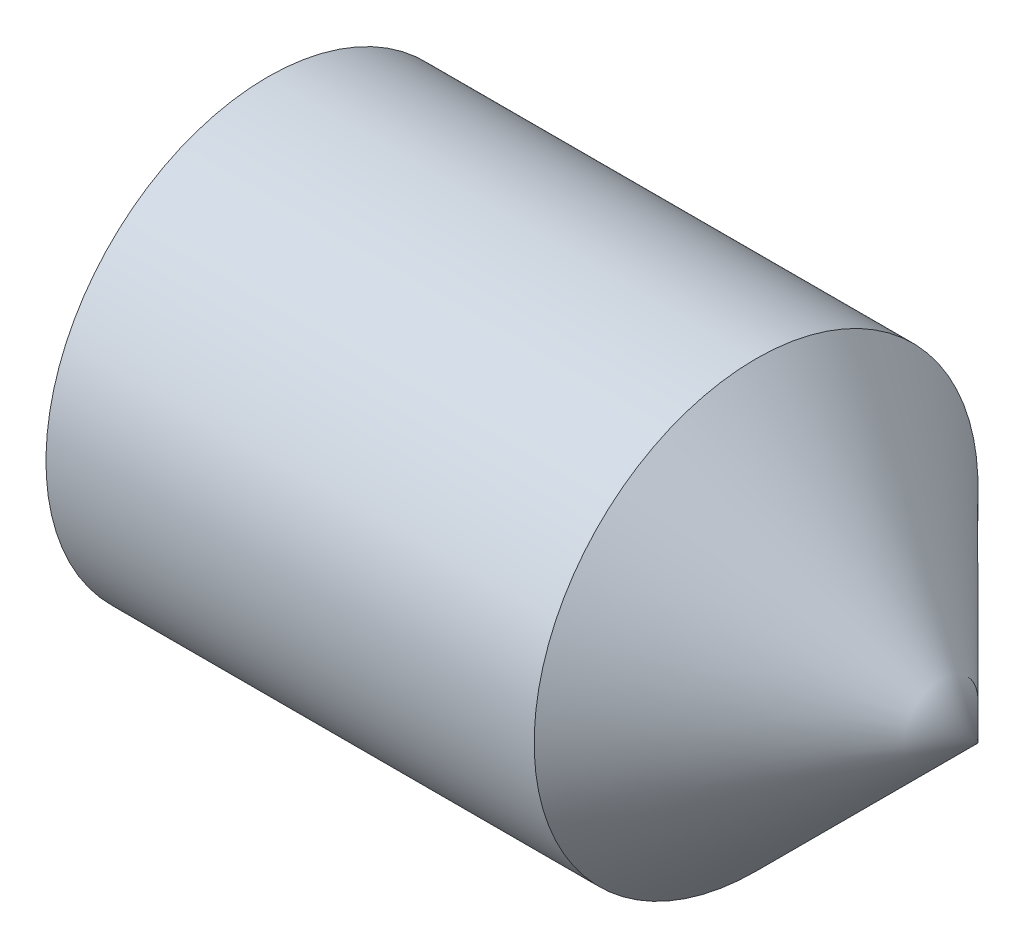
ISO-10303-21;
HEADER;
FILE_DESCRIPTION(('STEP AP214'),'2;1');
FILE_NAME('part.step','',(''),(''),'','','');
FILE_SCHEMA(('AUTOMOTIVE_DESIGN { 1 0 10303 214 1 1 1 1 }'));
ENDSEC;
DATA;
#1=APPLICATION_CONTEXT('core data for automotive mechanical design processes');
#2=APPLICATION_PROTOCOL_DEFINITION('international standard','automotive_design',2000,#1);
#3=PRODUCT_CONTEXT('',#1,'mechanical');
#4=PRODUCT('Part','Part','',(#3));
#5=PRODUCT_RELATED_PRODUCT_CATEGORY('part','',(#4));
#6=PRODUCT_DEFINITION_FORMATION('','',#4);
#7=PRODUCT_DEFINITION_CONTEXT('part definition',#1,'design');
#8=PRODUCT_DEFINITION('design','',#6,#7);
#9=PRODUCT_DEFINITION_SHAPE('','',#8);
#10=(LENGTH_UNIT() NAMED_UNIT(*) SI_UNIT(.MILLI.,.METRE.));
#11=(NAMED_UNIT(*) PLANE_ANGLE_UNIT() SI_UNIT($,.RADIAN.));
#12=(NAMED_UNIT(*) SI_UNIT($,.STERADIAN.) SOLID_ANGLE_UNIT());
#13=UNCERTAINTY_MEASURE_WITH_UNIT(LENGTH_MEASURE(1.E-05),#10,'distance_accuracy_value','');
#14=(GEOMETRIC_REPRESENTATION_CONTEXT(3) GLOBAL_UNCERTAINTY_ASSIGNED_CONTEXT((#13)) GLOBAL_UNIT_ASSIGNED_CONTEXT((#10,
#11,#12)) REPRESENTATION_CONTEXT('',''));
#15=CARTESIAN_POINT('',(0.,0.,0.));
#16=DIRECTION('',(0.,0.,1.));
#17=DIRECTION('',(1.,0.,0.));
#18=AXIS2_PLACEMENT_3D('',#15,#16,#17);
#19=CARTESIAN_POINT('',(0.,3.96874999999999,0.));
#20=DIRECTION('',(-1.,0.,0.));
#21=DIRECTION('',(0.,-1.,0.));
#22=AXIS2_PLACEMENT_3D('',#19,#20,#21);
#23=PLANE('',#22);
#24=DIRECTION('',(0.,0.709496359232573,0.70470910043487));
#25=VECTOR('',#24,1.);
#26=CARTESIAN_POINT('',(0.,-2.20772449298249,0.599575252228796));
#27=LINE('',#26,#25);
#28=CARTESIAN_POINT('',(0.,-2.20772449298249,0.599575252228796));
#29=VERTEX_POINT('',#28);
#30=CARTESIAN_POINT('',(0.,-0.584614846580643,2.21173312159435));
#31=VERTEX_POINT('',#30);
#32=EDGE_CURVE('E395',#29,#31,#27,.T.);
#33=ORIENTED_EDGE('',*,*,#32,.F.);
#34=DIRECTION('',(0.,-0.255547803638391,0.966796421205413));
#35=VECTOR('',#34,1.);
#36=CARTESIAN_POINT('',(0.,-1.62310964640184,-1.61215786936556));
#37=LINE('',#36,#35);
#38=CARTESIAN_POINT('',(0.,-1.62310964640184,-1.61215786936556));
#39=VERTEX_POINT('',#38);
#40=EDGE_CURVE('E463',#39,#29,#37,.T.);
#41=ORIENTED_EDGE('',*,*,#40,.F.);
#42=DIRECTION('',(0.,-0.965044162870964,0.262087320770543));
#43=VECTOR('',#42,1.);
#44=CARTESIAN_POINT('',(0.,0.584614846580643,-2.21173312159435));
#45=LINE('',#44,#43);
#46=CARTESIAN_POINT('',(0.,0.584614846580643,-2.21173312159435));
#47=VERTEX_POINT('',#46);
#48=EDGE_CURVE('E457',#47,#39,#45,.T.);
#49=ORIENTED_EDGE('',*,*,#48,.F.);
#50=DIRECTION('',(0.,-0.709496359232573,-0.70470910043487));
#51=VECTOR('',#50,1.);
#52=CARTESIAN_POINT('',(0.,2.20772449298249,-0.599575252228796));
#53=LINE('',#52,#51);
#54=CARTESIAN_POINT('',(0.,2.20772449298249,-0.599575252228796));
#55=VERTEX_POINT('',#54);
#56=EDGE_CURVE('E455',#55,#47,#53,.T.);
#57=ORIENTED_EDGE('',*,*,#56,.F.);
#58=DIRECTION('',(0.,0.255547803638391,-0.966796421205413));
#59=VECTOR('',#58,1.);
#60=CARTESIAN_POINT('',(0.,1.62310964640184,1.61215786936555));
#61=LINE('',#60,#59);
#62=CARTESIAN_POINT('',(0.,1.62310964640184,1.61215786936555));
#63=VERTEX_POINT('',#62);
#64=EDGE_CURVE('E437',#63,#55,#61,.T.);
#65=ORIENTED_EDGE('',*,*,#64,.F.);
#66=DIRECTION('',(0.,0.965044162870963,-0.262087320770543));
#67=VECTOR('',#66,1.);
#68=CARTESIAN_POINT('',(0.,-0.584614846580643,2.21173312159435));
#69=LINE('',#68,#67);
#70=EDGE_CURVE('E448',#31,#63,#69,.T.);
#71=ORIENTED_EDGE('',*,*,#70,.F.);
#72=EDGE_LOOP('',(#33,#41,#49,#57,#65,#71));
#73=FACE_BOUND('',#72,.T.);
#74=CARTESIAN_POINT('',(0.,0.,0.));
#75=DIRECTION('',(1.,0.,0.));
#76=DIRECTION('',(0.,1.,0.));
#77=AXIS2_PLACEMENT_3D('',#74,#75,#76);
#78=CIRCLE('',#77,3.96875);
#79=CARTESIAN_POINT('',(0.,3.96874999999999,0.));
#80=VERTEX_POINT('',#79);
#81=EDGE_CURVE('E11',#80,#80,#78,.T.);
#82=ORIENTED_EDGE('',*,*,#81,.F.);
#83=EDGE_LOOP('',(#82));
#84=FACE_BOUND('',#83,.T.);
#85=ADVANCED_FACE('F381',(#73,#84),#23,.T.);
#86=CARTESIAN_POINT('',(12.7,0.,0.));
#87=DIRECTION('',(1.,0.,0.));
#88=DIRECTION('',(0.,1.,0.));
#89=AXIS2_PLACEMENT_3D('',#86,#87,#88);
#90=CYLINDRICAL_SURFACE('',#89,3.96875);
#91=ORIENTED_EDGE('',*,*,#81,.T.);
#92=EDGE_LOOP('',(#91));
#93=FACE_BOUND('',#92,.T.);
#94=CARTESIAN_POINT('',(8.73125000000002,0.,0.));
#95=DIRECTION('',(1.,0.,0.));
#96=DIRECTION('',(0.,1.,0.));
#97=AXIS2_PLACEMENT_3D('',#94,#95,#96);
#98=CIRCLE('',#97,3.96875);
#99=CARTESIAN_POINT('',(8.73125000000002,3.96874999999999,0.));
#100=VERTEX_POINT('',#99);
#101=EDGE_CURVE('E388',#100,#100,#98,.T.);
#102=ORIENTED_EDGE('',*,*,#101,.F.);
#103=EDGE_LOOP('',(#102));
#104=FACE_BOUND('',#103,.T.);
#105=ADVANCED_FACE('F493',(#93,#104),#90,.T.);
#106=CARTESIAN_POINT('',(12.7,0.,0.));
#107=DIRECTION('',(-1.,0.,0.));
#108=DIRECTION('',(0.,-1.,0.));
#109=AXIS2_PLACEMENT_3D('',#106,#107,#108);
#110=CONICAL_SURFACE('',#109,0.,0.785398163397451);
#111=ORIENTED_EDGE('',*,*,#101,.T.);
#112=EDGE_LOOP('',(#111));
#113=FACE_BOUND('',#112,.T.);
#114=CARTESIAN_POINT('',(12.7,0.,0.));
#115=VERTEX_POINT('',#114);
#116=VERTEX_LOOP('',#115);
#117=FACE_BOUND('',#116,.T.);
#118=ADVANCED_FACE('F491',(#113,#117),#110,.T.);
#119=CARTESIAN_POINT('',(3.9624,-2.20772449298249,0.599575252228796));
#120=DIRECTION('',(0.,-0.70470910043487,0.709496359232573));
#121=DIRECTION('',(0.,-0.709496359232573,-0.70470910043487));
#122=AXIS2_PLACEMENT_3D('',#119,#120,#121);
#123=PLANE('',#122);
#124=ORIENTED_EDGE('',*,*,#32,.T.);
#125=DIRECTION('',(-1.,0.,0.));
#126=VECTOR('',#125,1.);
#127=CARTESIAN_POINT('',(3.9624,-0.584614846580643,2.21173312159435));
#128=LINE('',#127,#126);
#129=CARTESIAN_POINT('',(3.9624,-0.584614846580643,2.21173312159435));
#130=VERTEX_POINT('',#129);
#131=EDGE_CURVE('E445',#130,#31,#128,.T.);
#132=ORIENTED_EDGE('',*,*,#131,.F.);
#133=DIRECTION('',(0.,0.709496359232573,0.70470910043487));
#134=VECTOR('',#133,1.);
#135=CARTESIAN_POINT('',(3.9624,-2.20772449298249,0.599575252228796));
#136=LINE('',#135,#134);
#137=CARTESIAN_POINT('',(3.9624,-2.20772449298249,0.599575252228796));
#138=VERTEX_POINT('',#137);
#139=EDGE_CURVE('E466',#138,#130,#136,.T.);
#140=ORIENTED_EDGE('',*,*,#139,.F.);
#141=DIRECTION('',(-1.,0.,0.));
#142=VECTOR('',#141,1.);
#143=CARTESIAN_POINT('',(3.9624,-2.20772449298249,0.599575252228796));
#144=LINE('',#143,#142);
#145=EDGE_CURVE('E481',#138,#29,#144,.T.);
#146=ORIENTED_EDGE('',*,*,#145,.T.);
#147=EDGE_LOOP('',(#124,#132,#140,#146));
#148=FACE_BOUND('',#147,.T.);
#149=ADVANCED_FACE('F499',(#148),#123,.F.);
#150=CARTESIAN_POINT('',(3.9624,-1.62310964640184,-1.61215786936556));
#151=DIRECTION('',(0.,-0.966796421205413,-0.255547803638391));
#152=DIRECTION('',(0.,0.255547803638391,-0.966796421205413));
#153=AXIS2_PLACEMENT_3D('',#150,#151,#152);
#154=PLANE('',#153);
#155=ORIENTED_EDGE('',*,*,#40,.T.);
#156=ORIENTED_EDGE('',*,*,#145,.F.);
#157=DIRECTION('',(0.,-0.255547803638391,0.966796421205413));
#158=VECTOR('',#157,1.);
#159=CARTESIAN_POINT('',(3.9624,-1.62310964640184,-1.61215786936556));
#160=LINE('',#159,#158);
#161=CARTESIAN_POINT('',(3.9624,-1.62310964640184,-1.61215786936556));
#162=VERTEX_POINT('',#161);
#163=EDGE_CURVE('E478',#162,#138,#160,.T.);
#164=ORIENTED_EDGE('',*,*,#163,.F.);
#165=DIRECTION('',(-1.,0.,0.));
#166=VECTOR('',#165,1.);
#167=CARTESIAN_POINT('',(3.9624,-1.62310964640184,-1.61215786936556));
#168=LINE('',#167,#166);
#169=EDGE_CURVE('E483',#162,#39,#168,.T.);
#170=ORIENTED_EDGE('',*,*,#169,.T.);
#171=EDGE_LOOP('',(#155,#156,#164,#170));
#172=FACE_BOUND('',#171,.T.);
#173=ADVANCED_FACE('F505',(#172),#154,.F.);
#174=CARTESIAN_POINT('',(3.9624,0.584614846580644,-2.21173312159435));
#175=DIRECTION('',(0.,-0.262087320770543,-0.965044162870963));
#176=DIRECTION('',(0.,0.965044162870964,-0.262087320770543));
#177=AXIS2_PLACEMENT_3D('',#174,#175,#176);
#178=PLANE('',#177);
#179=ORIENTED_EDGE('',*,*,#48,.T.);
#180=ORIENTED_EDGE('',*,*,#169,.F.);
#181=DIRECTION('',(0.,-0.965044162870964,0.262087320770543));
#182=VECTOR('',#181,1.);
#183=CARTESIAN_POINT('',(3.9624,0.584614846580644,-2.21173312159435));
#184=LINE('',#183,#182);
#185=CARTESIAN_POINT('',(3.9624,0.584614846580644,-2.21173312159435));
#186=VERTEX_POINT('',#185);
#187=EDGE_CURVE('E475',#186,#162,#184,.T.);
#188=ORIENTED_EDGE('',*,*,#187,.F.);
#189=DIRECTION('',(-1.,0.,0.));
#190=VECTOR('',#189,1.);
#191=CARTESIAN_POINT('',(3.9624,0.584614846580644,-2.21173312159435));
#192=LINE('',#191,#190);
#193=EDGE_CURVE('E485',#186,#47,#192,.T.);
#194=ORIENTED_EDGE('',*,*,#193,.T.);
#195=EDGE_LOOP('',(#179,#180,#188,#194));
#196=FACE_BOUND('',#195,.T.);
#197=ADVANCED_FACE('F514',(#196),#178,.F.);
#198=CARTESIAN_POINT('',(3.9624,2.20772449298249,-0.599575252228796));
#199=DIRECTION('',(0.,0.70470910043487,-0.709496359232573));
#200=DIRECTION('',(0.,0.709496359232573,0.70470910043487));
#201=AXIS2_PLACEMENT_3D('',#198,#199,#200);
#202=PLANE('',#201);
#203=ORIENTED_EDGE('',*,*,#56,.T.);
#204=ORIENTED_EDGE('',*,*,#193,.F.);
#205=DIRECTION('',(0.,-0.709496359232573,-0.70470910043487));
#206=VECTOR('',#205,1.);
#207=CARTESIAN_POINT('',(3.9624,2.20772449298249,-0.599575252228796));
#208=LINE('',#207,#206);
#209=CARTESIAN_POINT('',(3.9624,2.20772449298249,-0.599575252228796));
#210=VERTEX_POINT('',#209);
#211=EDGE_CURVE('E472',#210,#186,#208,.T.);
#212=ORIENTED_EDGE('',*,*,#211,.F.);
#213=DIRECTION('',(-1.,0.,0.));
#214=VECTOR('',#213,1.);
#215=CARTESIAN_POINT('',(3.9624,2.20772449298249,-0.599575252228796));
#216=LINE('',#215,#214);
#217=EDGE_CURVE('E444',#210,#55,#216,.T.);
#218=ORIENTED_EDGE('',*,*,#217,.T.);
#219=EDGE_LOOP('',(#203,#204,#212,#218));
#220=FACE_BOUND('',#219,.T.);
#221=ADVANCED_FACE('F511',(#220),#202,.F.);
#222=CARTESIAN_POINT('',(3.9624,1.62310964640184,1.61215786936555));
#223=DIRECTION('',(0.,0.966796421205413,0.255547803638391));
#224=DIRECTION('',(0.,-0.255547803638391,0.966796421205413));
#225=AXIS2_PLACEMENT_3D('',#222,#223,#224);
#226=PLANE('',#225);
#227=ORIENTED_EDGE('',*,*,#64,.T.);
#228=ORIENTED_EDGE('',*,*,#217,.F.);
#229=DIRECTION('',(0.,0.255547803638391,-0.966796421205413));
#230=VECTOR('',#229,1.);
#231=CARTESIAN_POINT('',(3.9624,1.62310964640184,1.61215786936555));
#232=LINE('',#231,#230);
#233=CARTESIAN_POINT('',(3.9624,1.62310964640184,1.61215786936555));
#234=VERTEX_POINT('',#233);
#235=EDGE_CURVE('E440',#234,#210,#232,.T.);
#236=ORIENTED_EDGE('',*,*,#235,.F.);
#237=DIRECTION('',(-1.,0.,0.));
#238=VECTOR('',#237,1.);
#239=CARTESIAN_POINT('',(3.9624,1.62310964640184,1.61215786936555));
#240=LINE('',#239,#238);
#241=EDGE_CURVE('E433',#234,#63,#240,.T.);
#242=ORIENTED_EDGE('',*,*,#241,.T.);
#243=EDGE_LOOP('',(#227,#228,#236,#242));
#244=FACE_BOUND('',#243,.T.);
#245=ADVANCED_FACE('F435',(#244),#226,.F.);
#246=CARTESIAN_POINT('',(3.9624,-0.584614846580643,2.21173312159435));
#247=DIRECTION('',(0.,0.262087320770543,0.965044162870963));
#248=DIRECTION('',(0.,-0.965044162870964,0.262087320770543));
#249=AXIS2_PLACEMENT_3D('',#246,#247,#248);
#250=PLANE('',#249);
#251=ORIENTED_EDGE('',*,*,#70,.T.);
#252=ORIENTED_EDGE('',*,*,#241,.F.);
#253=DIRECTION('',(0.,0.965044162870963,-0.262087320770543));
#254=VECTOR('',#253,1.);
#255=CARTESIAN_POINT('',(3.9624,-0.584614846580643,2.21173312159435));
#256=LINE('',#255,#254);
#257=EDGE_CURVE('E469',#130,#234,#256,.T.);
#258=ORIENTED_EDGE('',*,*,#257,.F.);
#259=ORIENTED_EDGE('',*,*,#131,.T.);
#260=EDGE_LOOP('',(#251,#252,#258,#259));
#261=FACE_BOUND('',#260,.T.);
#262=ADVANCED_FACE('F449',(#261),#250,.F.);
#263=CARTESIAN_POINT('',(3.9624,1.0384947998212,3.82389099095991));
#264=DIRECTION('',(-1.,0.,0.));
#265=DIRECTION('',(0.,-1.,0.));
#266=AXIS2_PLACEMENT_3D('',#263,#264,#265);
#267=PLANE('',#266);
#268=ORIENTED_EDGE('',*,*,#139,.T.);
#269=ORIENTED_EDGE('',*,*,#257,.T.);
#270=ORIENTED_EDGE('',*,*,#235,.T.);
#271=ORIENTED_EDGE('',*,*,#211,.T.);
#272=ORIENTED_EDGE('',*,*,#187,.T.);
#273=ORIENTED_EDGE('',*,*,#163,.T.);
#274=EDGE_LOOP('',(#268,#269,#270,#271,#272,#273));
#275=FACE_BOUND('',#274,.T.);
#276=ADVANCED_FACE('F508',(#275),#267,.T.);
#277=CLOSED_SHELL('',(#85,#105,#118,#149,#173,#197,#221,#245,#262,#276));
#278=MANIFOLD_SOLID_BREP('B2',#277);
#279=ADVANCED_BREP_SHAPE_REPRESENTATION('',(#18,#278),#14);
#280=SHAPE_DEFINITION_REPRESENTATION(#9,#279);
ENDSEC;
END-ISO-10303-21;
